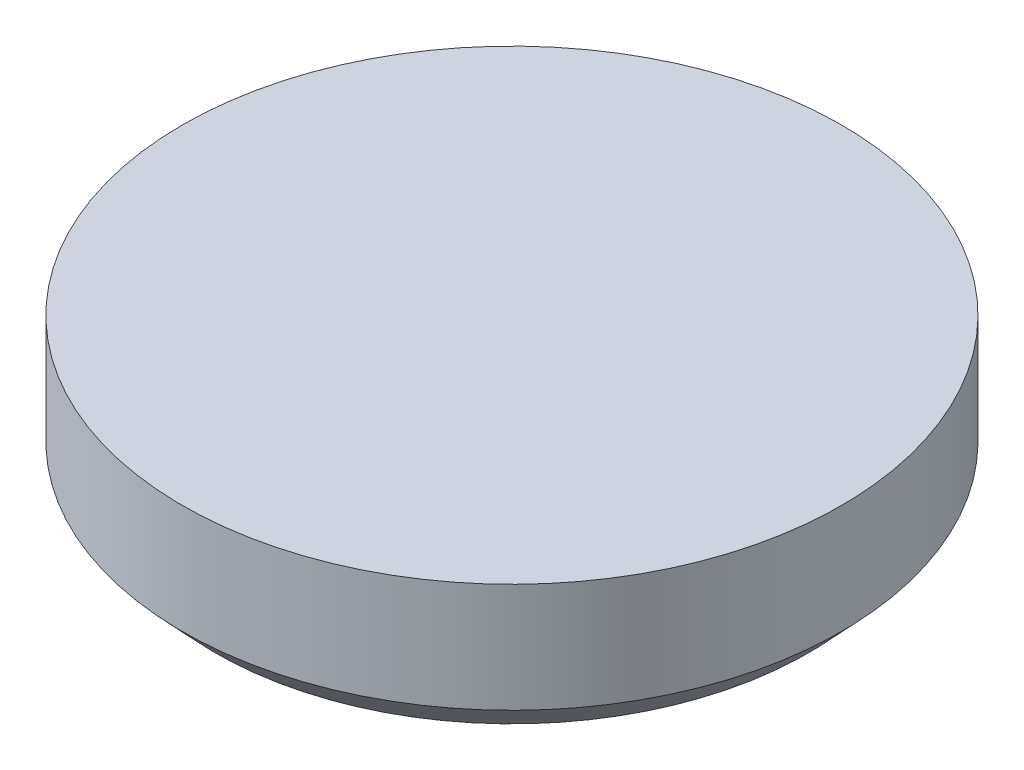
from build123d import *


with BuildPart() as part:
    # Sketch 1 → Revolve 1 (revolve)
    with BuildSketch(Plane.XY, mode=Mode.PRIVATE) as revolve_1_sk:
        Polygon((0, 350), (0, 0), (720, 0), (800, 85), (800, 350), align=None)
    revolve(revolve_1_sk.sketch.rotate(Axis((0, 350, 0), (0, -1, 0)), 180), axis=Axis((0, 350, 0), (0, -1, 0)))


solid = part.part
